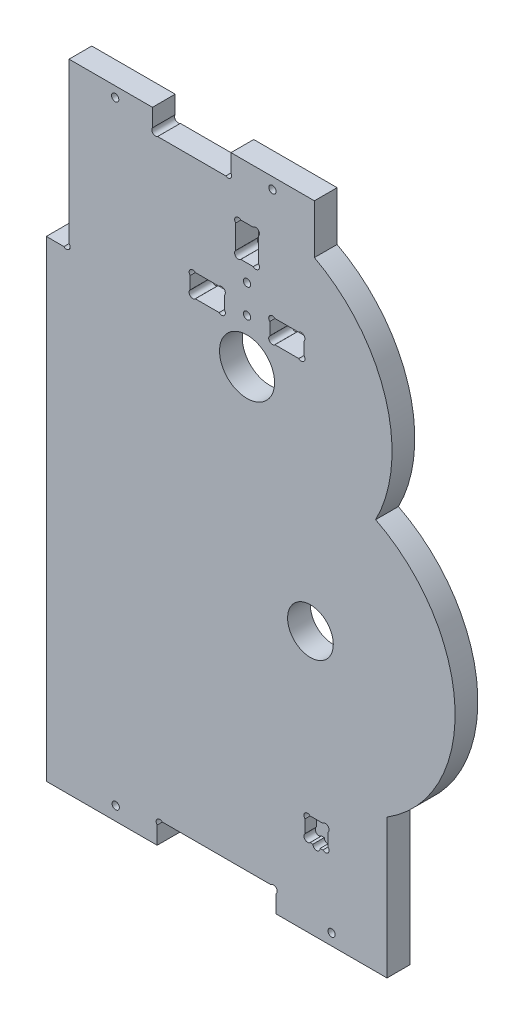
from build123d import *

# Parameters (mm, degrees)
ESQUISSE1_R             = 10.05
ESQUISSE1_R_2           = 12.1
ESQUISSE1_R_3           = 1.6
BOSS_EXTRU_1_DEPTH      = 10
ENL_V_MAT_EXTRU_7_DEPTH = 10
ENL_V_MAT_EXTRU_8_DEPTH = 252.921083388
ESQUISSE14_R            = 1.6
ENL_V_MAT_EXTRU_9_DEPTH = 10
ESQUISSE15_W            = 21.092655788
ESQUISSE15_H            = 19.898731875
BOSS_EXTRU_2_DEPTH      = 5


with BuildPart() as part:
    # Esquisse1 → Boss.-Extru.1 (new body)
    with BuildSketch(Plane.XY):
        with BuildLine():
            Line((24.858182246, -223.937847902), (34.858182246, -223.937847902))
            Line((34.858182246, -223.937847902), (34.858182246, -162.655636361))
            ThreePointArc((34.858182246, -162.655636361), (64.731792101, -105.820924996), (29.858182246, -51.909439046))
            ThreePointArc((29.858182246, -51.909439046), (34.151960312, -3.2006892), (2.92254892, 34.425135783))
            Line((2.92254892, 34.425135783), (2.92254892, 56.062152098))
            Line((2.92254892, 56.062152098), (-114.961178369, 56.062152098))
            Line((-114.961178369, 56.062152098), (-114.961178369, -223.937847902))
            Line((-114.961178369, -223.937847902), (24.858182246, -223.937847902))
        make_face()
        with Locations((1.188821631, -108.689780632)):
            Circle(ESQUISSE1_R, mode=Mode.SUBTRACT)
        with Locations((-26.695612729, -21.937847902)):
            Circle(ESQUISSE1_R_2, mode=Mode.SUBTRACT)
        with Locations((-26.695612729, -2.437847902)):
            Circle(ESQUISSE1_R_3, mode=Mode.SUBTRACT)
        with Locations((-26.695612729, 10.062152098)):
            Circle(ESQUISSE1_R_3, mode=Mode.SUBTRACT)
        with BuildLine():
            Line((1.049853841, -189.265771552), (2.262112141, -189.265771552))
            ThreePointArc((2.262112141, -189.265771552), (3.862112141, -190.865771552), (5.462112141, -189.265771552))
            Line((5.462112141, -189.265771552), (6.674370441, -189.265771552))
            ThreePointArc((6.674370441, -189.265771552), (8.937112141, -189.265771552), (8.937112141, -187.003029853))
            Line((8.937112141, -187.003029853), (8.937112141, -181.378513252))
            ThreePointArc((8.937112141, -181.378513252), (8.937112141, -179.115771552), (6.674370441, -179.115771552))
            Line((6.674370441, -179.115771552), (1.049853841, -179.115771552))
            ThreePointArc((1.049853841, -179.115771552), (-1.212887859, -179.115771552), (-1.212887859, -181.378513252))
            Line((-1.212887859, -181.378513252), (-1.212887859, -187.003029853))
            ThreePointArc((-1.212887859, -187.003029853), (-1.212887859, -189.265771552), (1.049853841, -189.265771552))
        make_face(mode=Mode.SUBTRACT)
        with BuildLine():
            Line((-36.695612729, -5.175106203), (-36.695612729, 0.299410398))
            ThreePointArc((-36.695612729, 0.299410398), (-36.695612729, 2.562152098), (-38.958354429, 2.562152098))
            Line((-38.958354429, 2.562152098), (-49.432871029, 2.562152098))
            ThreePointArc((-49.432871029, 2.562152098), (-51.695612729, 2.562152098), (-51.695612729, 0.299410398))
            Line((-51.695612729, 0.299410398), (-51.695612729, -5.175106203))
            ThreePointArc((-51.695612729, -5.175106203), (-51.695612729, -7.437847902), (-49.432871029, -7.437847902))
            Line((-49.432871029, -7.437847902), (-38.958354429, -7.437847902))
            ThreePointArc((-38.958354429, -7.437847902), (-36.695612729, -7.437847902), (-36.695612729, -5.175106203))
        make_face(mode=Mode.SUBTRACT)
        with BuildLine():
            Line((-14.432871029, -7.437847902), (-3.958354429, -7.437847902))
            ThreePointArc((-3.958354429, -7.437847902), (-1.695612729, -7.437847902), (-1.695612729, -5.175106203))
            Line((-1.695612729, -5.175106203), (-1.695612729, 0.299410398))
            ThreePointArc((-1.695612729, 0.299410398), (-1.695612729, 2.562152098), (-3.958354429, 2.562152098))
            Line((-3.958354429, 2.562152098), (-14.432871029, 2.562152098))
            ThreePointArc((-14.432871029, 2.562152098), (-16.695612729, 2.562152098), (-16.695612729, 0.299410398))
            Line((-16.695612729, 0.299410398), (-16.695612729, -5.175106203))
            ThreePointArc((-16.695612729, -5.175106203), (-16.695612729, -7.437847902), (-14.432871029, -7.437847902))
        make_face(mode=Mode.SUBTRACT)
        with BuildLine():
            Line((-23.958354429, 32.562152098), (-29.432871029, 32.562152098))
            ThreePointArc((-29.432871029, 32.562152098), (-31.695612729, 32.562152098), (-31.695612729, 30.299410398))
            Line((-31.695612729, 30.299410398), (-31.695612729, 19.824893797))
            ThreePointArc((-31.695612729, 19.824893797), (-31.695612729, 17.562152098), (-29.432871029, 17.562152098))
            Line((-29.432871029, 17.562152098), (-23.958354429, 17.562152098))
            ThreePointArc((-23.958354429, 17.562152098), (-21.695612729, 17.562152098), (-21.695612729, 19.824893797))
            Line((-21.695612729, 19.824893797), (-21.695612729, 30.299410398))
            ThreePointArc((-21.695612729, 30.299410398), (-21.695612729, 32.562152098), (-23.958354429, 32.562152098))
        make_face(mode=Mode.SUBTRACT)
    extrude(amount=BOSS_EXTRU_1_DEPTH)

    # Esquisse11 → Enl_v. mat.-Extru.7 (cut)
    with BuildSketch(Plane.XY.offset(10)):
        with BuildLine():
            Line((-33.75561722, 56.062152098), (-68.281178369, 56.062152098))
            Line((-68.281178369, 56.062152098), (-68.281178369, 48.251309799))
            ThreePointArc((-68.281178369, 48.251309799), (-68.063366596, 46.212428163), (-66.018397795, 46.062152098))
            Line((-66.018397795, 46.062152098), (-36.018397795, 46.062152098))
            ThreePointArc((-36.018397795, 46.062152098), (-33.973428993, 46.212428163), (-33.75561722, 48.251309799))
            Line((-33.75561722, 48.251309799), (-33.75561722, 56.062152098))
        make_face()
        with BuildLine():
            Line((-13.891817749, -223.937847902), (-66.211178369, -223.937847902))
            Line((-66.211178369, -223.937847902), (-66.211178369, -216.200589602))
            ThreePointArc((-66.211178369, -216.200589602), (-66.211178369, -213.937847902), (-63.948436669, -213.937847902))
            Line((-63.948436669, -213.937847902), (-16.154559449, -213.937847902))
            ThreePointArc((-16.154559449, -213.937847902), (-13.891817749, -213.937847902), (-13.891817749, -216.200589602))
            Line((-13.891817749, -216.200589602), (-13.891817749, -223.937847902))
        make_face()
    extrude(amount=-ENL_V_MAT_EXTRU_7_DEPTH, mode=Mode.SUBTRACT)

    # Esquisse13 → Enl_v. mat.-Extru.8 (cut, through all)
    with BuildSketch(Plane(origin=(0, 0, 0), x_dir=(-1, 0, 0), z_dir=(0, 0, -1))):
        with BuildLine():
            Line((107.223920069, -16.437847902), (114.961178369, -16.437847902))
            Line((114.961178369, -16.437847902), (114.961178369, 56.062152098))
            Line((114.961178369, 56.062152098), (104.961178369, 56.062152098))
            Line((104.961178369, 56.062152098), (104.961178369, -14.175106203))
            ThreePointArc((104.961178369, -14.175106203), (104.961178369, -16.437847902), (107.223920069, -16.437847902))
        make_face()
    extrude(amount=-ENL_V_MAT_EXTRU_8_DEPTH, mode=Mode.SUBTRACT)

    # Esquisse14 → Enl_v. mat.-Extru.9 (cut)
    with BuildSketch(Plane(origin=(0, 0, 0), x_dir=(-1, 0, 0), z_dir=(0, 0, -1))):
        with Locations((84.676425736, 51.591273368)):
            Circle(ESQUISSE14_R)
        with Locations((84.427521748, -217.940894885)):
            Circle(ESQUISSE14_R)
        with Locations((-10.483182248, -218.937847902)):
            Circle(ESQUISSE14_R)
        with Locations((15.525440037, 51.13729013)):
            Circle(ESQUISSE14_R)
    extrude(amount=-ENL_V_MAT_EXTRU_9_DEPTH, mode=Mode.SUBTRACT)

    # Esquisse15 → Boss.-Extru.2 (add)
    with BuildSketch(Plane(origin=(0, 0, 0), x_dir=(-1, 0, 0), z_dir=(0, 0, -1))):
        with Locations((-2.178934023, -186.41631706)):
            Rectangle(ESQUISSE15_W, ESQUISSE15_H)
    extrude(amount=-BOSS_EXTRU_2_DEPTH)


solid = part.part
